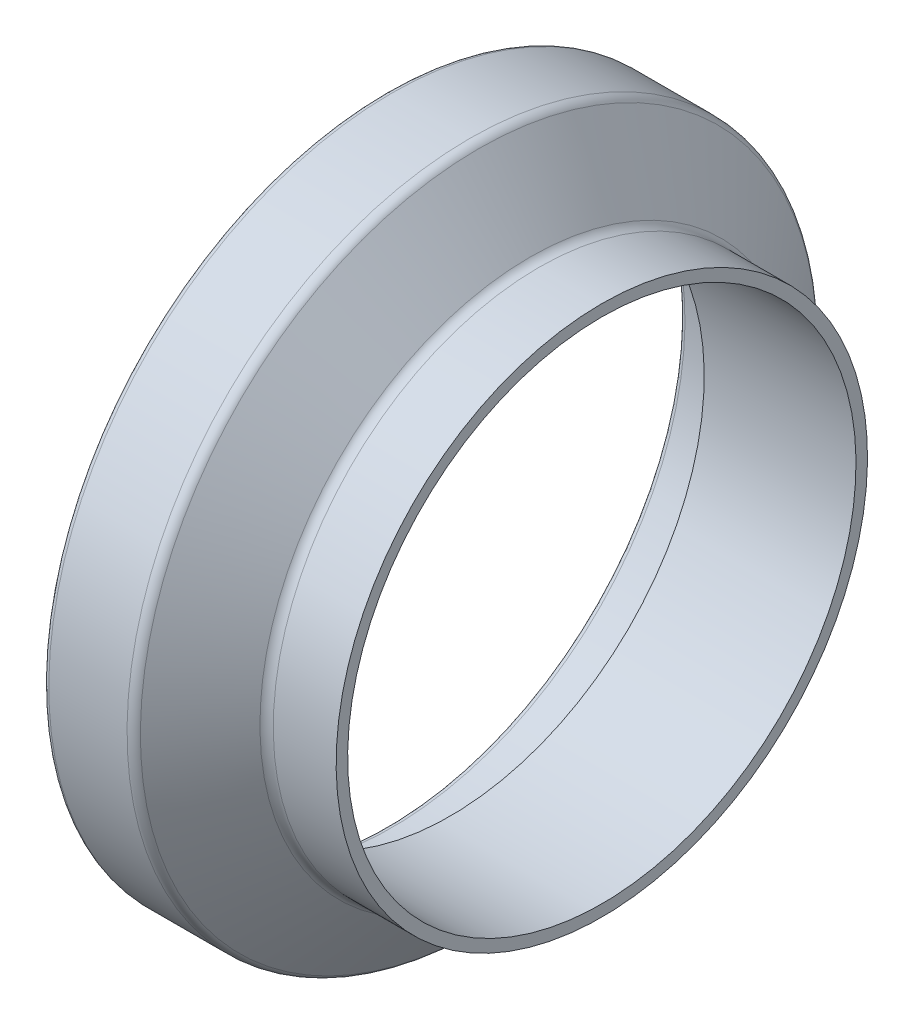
ISO-10303-21;
HEADER;
FILE_DESCRIPTION(('STEP AP214'),'2;1');
FILE_NAME('part.step','',(''),(''),'','','');
FILE_SCHEMA(('AUTOMOTIVE_DESIGN { 1 0 10303 214 1 1 1 1 }'));
ENDSEC;
DATA;
#1=APPLICATION_CONTEXT('core data for automotive mechanical design processes');
#2=APPLICATION_PROTOCOL_DEFINITION('international standard','automotive_design',2000,#1);
#3=PRODUCT_CONTEXT('',#1,'mechanical');
#4=PRODUCT('Part','Part','',(#3));
#5=PRODUCT_RELATED_PRODUCT_CATEGORY('part','',(#4));
#6=PRODUCT_DEFINITION_FORMATION('','',#4);
#7=PRODUCT_DEFINITION_CONTEXT('part definition',#1,'design');
#8=PRODUCT_DEFINITION('design','',#6,#7);
#9=PRODUCT_DEFINITION_SHAPE('','',#8);
#10=(LENGTH_UNIT() NAMED_UNIT(*) SI_UNIT(.MILLI.,.METRE.));
#11=(NAMED_UNIT(*) PLANE_ANGLE_UNIT() SI_UNIT($,.RADIAN.));
#12=(NAMED_UNIT(*) SI_UNIT($,.STERADIAN.) SOLID_ANGLE_UNIT());
#13=UNCERTAINTY_MEASURE_WITH_UNIT(LENGTH_MEASURE(1.E-05),#10,'distance_accuracy_value','');
#14=(GEOMETRIC_REPRESENTATION_CONTEXT(3) GLOBAL_UNCERTAINTY_ASSIGNED_CONTEXT((#13)) GLOBAL_UNIT_ASSIGNED_CONTEXT((#10,
#11,#12)) REPRESENTATION_CONTEXT('',''));
#15=CARTESIAN_POINT('',(0.,0.,0.));
#16=DIRECTION('',(0.,0.,1.));
#17=DIRECTION('',(1.,0.,0.));
#18=AXIS2_PLACEMENT_3D('',#15,#16,#17);
#19=CARTESIAN_POINT('',(-4.82698352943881,38.1,0.));
#20=DIRECTION('',(1.,0.,0.));
#21=DIRECTION('',(0.,1.,0.));
#22=AXIS2_PLACEMENT_3D('',#19,#20,#21);
#23=PLANE('',#22);
#24=CARTESIAN_POINT('',(-4.8269835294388,0.,0.));
#25=DIRECTION('',(1.,0.,0.));
#26=DIRECTION('',(0.,1.,0.));
#27=AXIS2_PLACEMENT_3D('',#24,#25,#26);
#28=CIRCLE('',#27,38.1);
#29=CARTESIAN_POINT('',(-4.82698352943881,38.1,0.));
#30=VERTEX_POINT('',#29);
#31=EDGE_CURVE('E74',#30,#30,#28,.T.);
#32=ORIENTED_EDGE('',*,*,#31,.T.);
#33=EDGE_LOOP('',(#32));
#34=FACE_BOUND('',#33,.T.);
#35=CARTESIAN_POINT('',(-4.8269835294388,0.,0.));
#36=DIRECTION('',(1.,0.,0.));
#37=DIRECTION('',(0.,1.,0.));
#38=AXIS2_PLACEMENT_3D('',#35,#36,#37);
#39=CIRCLE('',#38,36.449);
#40=CARTESIAN_POINT('',(-4.8269835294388,36.449,0.));
#41=VERTEX_POINT('',#40);
#42=EDGE_CURVE('E10',#41,#41,#39,.T.);
#43=ORIENTED_EDGE('',*,*,#42,.F.);
#44=EDGE_LOOP('',(#43));
#45=FACE_BOUND('',#44,.T.);
#46=ADVANCED_FACE('F31',(#34,#45),#23,.T.);
#47=CARTESIAN_POINT('',(0.,0.,0.));
#48=DIRECTION('',(1.,0.,0.));
#49=DIRECTION('',(0.,1.,0.));
#50=AXIS2_PLACEMENT_3D('',#47,#48,#49);
#51=CYLINDRICAL_SURFACE('',#50,36.449);
#52=ORIENTED_EDGE('',*,*,#42,.T.);
#53=EDGE_LOOP('',(#52));
#54=FACE_BOUND('',#53,.T.);
#55=CARTESIAN_POINT('',(-26.5947835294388,0.,0.));
#56=DIRECTION('',(1.,0.,0.));
#57=DIRECTION('',(0.,1.,0.));
#58=AXIS2_PLACEMENT_3D('',#55,#56,#57);
#59=CIRCLE('',#58,36.449);
#60=CARTESIAN_POINT('',(-26.5947835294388,36.449,0.));
#61=VERTEX_POINT('',#60);
#62=EDGE_CURVE('E37',#61,#61,#59,.T.);
#63=ORIENTED_EDGE('',*,*,#62,.F.);
#64=EDGE_LOOP('',(#63));
#65=FACE_BOUND('',#64,.T.);
#66=ADVANCED_FACE('F92',(#54,#65),#51,.F.);
#67=CARTESIAN_POINT('',(-26.5947835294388,36.449,0.));
#68=DIRECTION('',(-1.,0.,0.));
#69=DIRECTION('',(0.,-1.,0.));
#70=AXIS2_PLACEMENT_3D('',#67,#68,#69);
#71=PLANE('',#70);
#72=ORIENTED_EDGE('',*,*,#62,.T.);
#73=EDGE_LOOP('',(#72));
#74=FACE_BOUND('',#73,.T.);
#75=CARTESIAN_POINT('',(-26.5947835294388,0.,0.));
#76=DIRECTION('',(1.,0.,0.));
#77=DIRECTION('',(0.,1.,0.));
#78=AXIS2_PLACEMENT_3D('',#75,#76,#77);
#79=CIRCLE('',#78,41.2623);
#80=CARTESIAN_POINT('',(-26.5947835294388,41.2623,0.));
#81=VERTEX_POINT('',#80);
#82=EDGE_CURVE('E41',#81,#81,#79,.T.);
#83=ORIENTED_EDGE('',*,*,#82,.F.);
#84=EDGE_LOOP('',(#83));
#85=FACE_BOUND('',#84,.T.);
#86=ADVANCED_FACE('F96',(#74,#85),#71,.T.);
#87=CARTESIAN_POINT('',(-27.4075835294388,0.,0.));
#88=DIRECTION('',(1.,0.,0.));
#89=DIRECTION('',(0.,1.,0.));
#90=AXIS2_PLACEMENT_3D('',#87,#88,#89);
#91=TOROIDAL_SURFACE('',#90,41.2623,0.812800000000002);
#92=ORIENTED_EDGE('',*,*,#82,.T.);
#93=EDGE_LOOP('',(#92));
#94=FACE_BOUND('',#93,.T.);
#95=CARTESIAN_POINT('',(-27.4075835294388,0.,0.));
#96=DIRECTION('',(1.,0.,0.));
#97=DIRECTION('',(0.,1.,0.));
#98=AXIS2_PLACEMENT_3D('',#95,#96,#97);
#99=CIRCLE('',#98,42.0751);
#100=CARTESIAN_POINT('',(-27.4075835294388,42.0751,0.));
#101=VERTEX_POINT('',#100);
#102=EDGE_CURVE('E45',#101,#101,#99,.T.);
#103=ORIENTED_EDGE('',*,*,#102,.F.);
#104=EDGE_LOOP('',(#103));
#105=FACE_BOUND('',#104,.T.);
#106=ADVANCED_FACE('F100',(#94,#105),#91,.F.);
#107=CARTESIAN_POINT('',(0.,0.,0.));
#108=DIRECTION('',(1.,0.,0.));
#109=DIRECTION('',(0.,1.,0.));
#110=AXIS2_PLACEMENT_3D('',#107,#108,#109);
#111=CYLINDRICAL_SURFACE('',#110,42.0751);
#112=ORIENTED_EDGE('',*,*,#102,.T.);
#113=EDGE_LOOP('',(#112));
#114=FACE_BOUND('',#113,.T.);
#115=CARTESIAN_POINT('',(-34.9767835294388,0.,0.));
#116=DIRECTION('',(1.,0.,0.));
#117=DIRECTION('',(0.,1.,0.));
#118=AXIS2_PLACEMENT_3D('',#115,#116,#117);
#119=CIRCLE('',#118,42.0751);
#120=CARTESIAN_POINT('',(-34.9767835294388,42.0751,0.));
#121=VERTEX_POINT('',#120);
#122=EDGE_CURVE('E50',#121,#121,#119,.T.);
#123=ORIENTED_EDGE('',*,*,#122,.F.);
#124=EDGE_LOOP('',(#123));
#125=FACE_BOUND('',#124,.T.);
#126=ADVANCED_FACE('F106',(#114,#125),#111,.F.);
#127=CARTESIAN_POINT('',(-34.9767835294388,0.,0.));
#128=DIRECTION('',(1.,0.,0.));
#129=DIRECTION('',(0.,1.,0.));
#130=AXIS2_PLACEMENT_3D('',#127,#128,#129);
#131=TOROIDAL_SURFACE('',#130,42.8879,0.812800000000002);
#132=ORIENTED_EDGE('',*,*,#122,.T.);
#133=EDGE_LOOP('',(#132));
#134=FACE_BOUND('',#133,.T.);
#135=CARTESIAN_POINT('',(-35.7895835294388,0.,0.));
#136=DIRECTION('',(1.,0.,0.));
#137=DIRECTION('',(0.,1.,0.));
#138=AXIS2_PLACEMENT_3D('',#135,#136,#137);
#139=CIRCLE('',#138,42.8879);
#140=CARTESIAN_POINT('',(-35.7895835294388,42.8879,0.));
#141=VERTEX_POINT('',#140);
#142=EDGE_CURVE('E53',#141,#141,#139,.T.);
#143=ORIENTED_EDGE('',*,*,#142,.F.);
#144=EDGE_LOOP('',(#143));
#145=FACE_BOUND('',#144,.T.);
#146=ADVANCED_FACE('F110',(#134,#145),#131,.T.);
#147=CARTESIAN_POINT('',(-35.7895835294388,42.8879,0.));
#148=DIRECTION('',(-1.,0.,0.));
#149=DIRECTION('',(0.,-1.,0.));
#150=AXIS2_PLACEMENT_3D('',#147,#148,#149);
#151=PLANE('',#150);
#152=ORIENTED_EDGE('',*,*,#142,.T.);
#153=EDGE_LOOP('',(#152));
#154=FACE_BOUND('',#153,.T.);
#155=CARTESIAN_POINT('',(-35.7895835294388,0.,0.));
#156=DIRECTION('',(1.,0.,0.));
#157=DIRECTION('',(0.,1.,0.));
#158=AXIS2_PLACEMENT_3D('',#155,#156,#157);
#159=CIRCLE('',#158,48.3362);
#160=CARTESIAN_POINT('',(-35.7895835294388,48.3362,0.));
#161=VERTEX_POINT('',#160);
#162=EDGE_CURVE('E56',#161,#161,#159,.T.);
#163=ORIENTED_EDGE('',*,*,#162,.F.);
#164=EDGE_LOOP('',(#163));
#165=FACE_BOUND('',#164,.T.);
#166=ADVANCED_FACE('F114',(#154,#165),#151,.T.);
#167=CARTESIAN_POINT('',(-34.9767835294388,0.,0.));
#168=DIRECTION('',(1.,0.,0.));
#169=DIRECTION('',(0.,1.,0.));
#170=AXIS2_PLACEMENT_3D('',#167,#168,#169);
#171=TOROIDAL_SURFACE('',#170,48.3362,0.812800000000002);
#172=ORIENTED_EDGE('',*,*,#162,.T.);
#173=EDGE_LOOP('',(#172));
#174=FACE_BOUND('',#173,.T.);
#175=CARTESIAN_POINT('',(-34.9767835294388,0.,0.));
#176=DIRECTION('',(1.,0.,0.));
#177=DIRECTION('',(0.,1.,0.));
#178=AXIS2_PLACEMENT_3D('',#175,#176,#177);
#179=CIRCLE('',#178,49.149);
#180=CARTESIAN_POINT('',(-34.9767835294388,49.149,0.));
#181=VERTEX_POINT('',#180);
#182=EDGE_CURVE('E59',#181,#181,#179,.T.);
#183=ORIENTED_EDGE('',*,*,#182,.F.);
#184=EDGE_LOOP('',(#183));
#185=FACE_BOUND('',#184,.T.);
#186=ADVANCED_FACE('F118',(#174,#185),#171,.T.);
#187=CARTESIAN_POINT('',(0.,0.,0.));
#188=DIRECTION('',(1.,0.,0.));
#189=DIRECTION('',(0.,1.,0.));
#190=AXIS2_PLACEMENT_3D('',#187,#188,#189);
#191=CYLINDRICAL_SURFACE('',#190,49.149);
#192=ORIENTED_EDGE('',*,*,#182,.T.);
#193=EDGE_LOOP('',(#192));
#194=FACE_BOUND('',#193,.T.);
#195=CARTESIAN_POINT('',(-23.7604138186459,0.,0.));
#196=DIRECTION('',(1.,0.,0.));
#197=DIRECTION('',(0.,1.,0.));
#198=AXIS2_PLACEMENT_3D('',#195,#196,#197);
#199=CIRCLE('',#198,49.149);
#200=CARTESIAN_POINT('',(-23.7604138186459,49.149,0.));
#201=VERTEX_POINT('',#200);
#202=EDGE_CURVE('E62',#201,#201,#199,.T.);
#203=ORIENTED_EDGE('',*,*,#202,.F.);
#204=EDGE_LOOP('',(#203));
#205=FACE_BOUND('',#204,.T.);
#206=ADVANCED_FACE('F122',(#194,#205),#191,.T.);
#207=CARTESIAN_POINT('',(-23.7604138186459,0.,0.));
#208=DIRECTION('',(1.,0.,0.));
#209=DIRECTION('',(0.,1.,0.));
#210=AXIS2_PLACEMENT_3D('',#207,#208,#209);
#211=TOROIDAL_SURFACE('',#210,47.5488,1.6002);
#212=ORIENTED_EDGE('',*,*,#202,.T.);
#213=EDGE_LOOP('',(#212));
#214=FACE_BOUND('',#213,.T.);
#215=CARTESIAN_POINT('',(-22.4824372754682,0.,0.));
#216=DIRECTION('',(1.,0.,0.));
#217=DIRECTION('',(0.,1.,0.));
#218=AXIS2_PLACEMENT_3D('',#215,#216,#217);
#219=CIRCLE('',#218,48.5118244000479);
#220=CARTESIAN_POINT('',(-22.4824372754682,48.5118244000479,0.));
#221=VERTEX_POINT('',#220);
#222=EDGE_CURVE('E65',#221,#221,#219,.T.);
#223=ORIENTED_EDGE('',*,*,#222,.F.);
#224=EDGE_LOOP('',(#223));
#225=FACE_BOUND('',#224,.T.);
#226=ADVANCED_FACE('F126',(#214,#225),#211,.T.);
#227=CARTESIAN_POINT('',(-15.1167110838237,0.,0.));
#228=DIRECTION('',(-1.,0.,0.));
#229=DIRECTION('',(0.,-1.,0.));
#230=AXIS2_PLACEMENT_3D('',#227,#228,#229);
#231=CONICAL_SURFACE('',#230,38.7371755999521,0.925024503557);
#232=ORIENTED_EDGE('',*,*,#222,.T.);
#233=EDGE_LOOP('',(#232));
#234=FACE_BOUND('',#233,.T.);
#235=CARTESIAN_POINT('',(-15.1167110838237,0.,0.));
#236=DIRECTION('',(1.,0.,0.));
#237=DIRECTION('',(0.,1.,0.));
#238=AXIS2_PLACEMENT_3D('',#235,#236,#237);
#239=CIRCLE('',#238,38.7371755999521);
#240=CARTESIAN_POINT('',(-15.1167110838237,38.7371755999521,0.));
#241=VERTEX_POINT('',#240);
#242=EDGE_CURVE('E68',#241,#241,#239,.T.);
#243=ORIENTED_EDGE('',*,*,#242,.F.);
#244=EDGE_LOOP('',(#243));
#245=FACE_BOUND('',#244,.T.);
#246=ADVANCED_FACE('F88',(#234,#245),#231,.T.);
#247=CARTESIAN_POINT('',(-13.838734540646,0.,0.));
#248=DIRECTION('',(1.,0.,0.));
#249=DIRECTION('',(0.,1.,0.));
#250=AXIS2_PLACEMENT_3D('',#247,#248,#249);
#251=TOROIDAL_SURFACE('',#250,39.7002,1.6002);
#252=ORIENTED_EDGE('',*,*,#242,.T.);
#253=EDGE_LOOP('',(#252));
#254=FACE_BOUND('',#253,.T.);
#255=CARTESIAN_POINT('',(-13.838734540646,0.,0.));
#256=DIRECTION('',(1.,0.,0.));
#257=DIRECTION('',(0.,1.,0.));
#258=AXIS2_PLACEMENT_3D('',#255,#256,#257);
#259=CIRCLE('',#258,38.1);
#260=CARTESIAN_POINT('',(-13.838734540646,38.1,0.));
#261=VERTEX_POINT('',#260);
#262=EDGE_CURVE('E71',#261,#261,#259,.T.);
#263=ORIENTED_EDGE('',*,*,#262,.F.);
#264=EDGE_LOOP('',(#263));
#265=FACE_BOUND('',#264,.T.);
#266=ADVANCED_FACE('F82',(#254,#265),#251,.F.);
#267=CARTESIAN_POINT('',(0.,0.,0.));
#268=DIRECTION('',(1.,0.,0.));
#269=DIRECTION('',(0.,1.,0.));
#270=AXIS2_PLACEMENT_3D('',#267,#268,#269);
#271=CYLINDRICAL_SURFACE('',#270,38.1);
#272=ORIENTED_EDGE('',*,*,#262,.T.);
#273=EDGE_LOOP('',(#272));
#274=FACE_BOUND('',#273,.T.);
#275=ORIENTED_EDGE('',*,*,#31,.F.);
#276=EDGE_LOOP('',(#275));
#277=FACE_BOUND('',#276,.T.);
#278=ADVANCED_FACE('F80',(#274,#277),#271,.T.);
#279=CLOSED_SHELL('',(#46,#66,#86,#106,#126,#146,#166,#186,#206,#226,#246,#266,#278));
#280=MANIFOLD_SOLID_BREP('B2',#279);
#281=ADVANCED_BREP_SHAPE_REPRESENTATION('',(#18,#280),#14);
#282=SHAPE_DEFINITION_REPRESENTATION(#9,#281);
ENDSEC;
END-ISO-10303-21;
